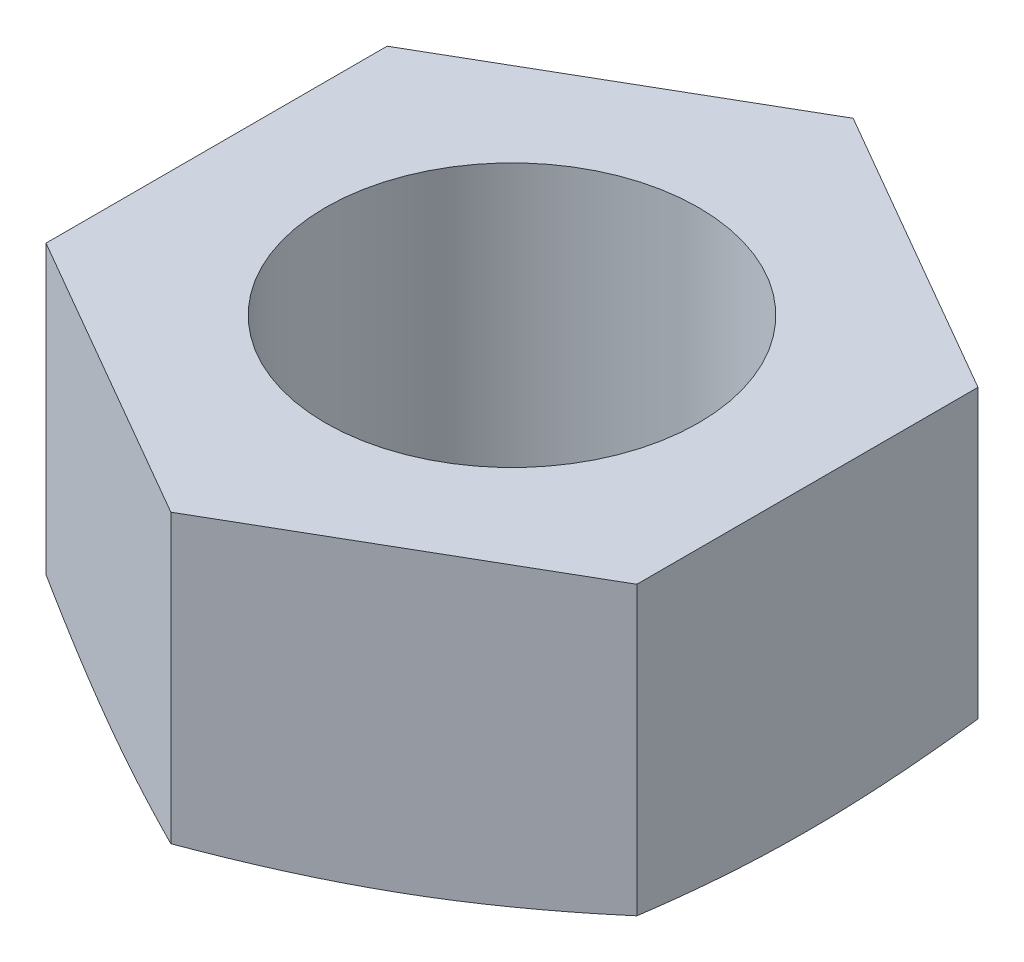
ISO-10303-21;
HEADER;
FILE_DESCRIPTION(('STEP AP214'),'2;1');
FILE_NAME('part.step','',(''),(''),'','','');
FILE_SCHEMA(('AUTOMOTIVE_DESIGN { 1 0 10303 214 1 1 1 1 }'));
ENDSEC;
DATA;
#1=APPLICATION_CONTEXT('core data for automotive mechanical design processes');
#2=APPLICATION_PROTOCOL_DEFINITION('international standard','automotive_design',2000,#1);
#3=PRODUCT_CONTEXT('',#1,'mechanical');
#4=PRODUCT('Part','Part','',(#3));
#5=PRODUCT_RELATED_PRODUCT_CATEGORY('part','',(#4));
#6=PRODUCT_DEFINITION_FORMATION('','',#4);
#7=PRODUCT_DEFINITION_CONTEXT('part definition',#1,'design');
#8=PRODUCT_DEFINITION('design','',#6,#7);
#9=PRODUCT_DEFINITION_SHAPE('','',#8);
#10=(LENGTH_UNIT() NAMED_UNIT(*) SI_UNIT(.MILLI.,.METRE.));
#11=(NAMED_UNIT(*) PLANE_ANGLE_UNIT() SI_UNIT($,.RADIAN.));
#12=(NAMED_UNIT(*) SI_UNIT($,.STERADIAN.) SOLID_ANGLE_UNIT());
#13=UNCERTAINTY_MEASURE_WITH_UNIT(LENGTH_MEASURE(1.E-05),#10,'distance_accuracy_value','');
#14=(GEOMETRIC_REPRESENTATION_CONTEXT(3) GLOBAL_UNCERTAINTY_ASSIGNED_CONTEXT((#13)) GLOBAL_UNIT_ASSIGNED_CONTEXT((#10,
#11,#12)) REPRESENTATION_CONTEXT('',''));
#15=CARTESIAN_POINT('',(0.,0.,0.));
#16=DIRECTION('',(0.,0.,1.));
#17=DIRECTION('',(1.,0.,0.));
#18=AXIS2_PLACEMENT_3D('',#15,#16,#17);
#19=CARTESIAN_POINT('',(0.,0.,0.));
#20=DIRECTION('',(0.,1.,0.));
#21=DIRECTION('',(0.,0.,1.));
#22=AXIS2_PLACEMENT_3D('',#19,#20,#21);
#23=CYLINDRICAL_SURFACE('',#22,6.);
#24=CARTESIAN_POINT('',(0.,0.,0.));
#25=DIRECTION('',(0.,1.,0.));
#26=DIRECTION('',(0.,0.,1.));
#27=AXIS2_PLACEMENT_3D('',#24,#25,#26);
#28=CIRCLE('',#27,6.);
#29=CARTESIAN_POINT('',(0.,0.,6.));
#30=VERTEX_POINT('',#29);
#31=EDGE_CURVE('E88',#30,#30,#28,.T.);
#32=ORIENTED_EDGE('',*,*,#31,.F.);
#33=EDGE_LOOP('',(#32));
#34=FACE_BOUND('',#33,.T.);
#35=CARTESIAN_POINT('',(0.,10.,0.));
#36=DIRECTION('',(0.,1.,0.));
#37=DIRECTION('',(0.,0.,1.));
#38=AXIS2_PLACEMENT_3D('',#35,#36,#37);
#39=CIRCLE('',#38,6.);
#40=CARTESIAN_POINT('',(0.,10.,6.));
#41=VERTEX_POINT('',#40);
#42=EDGE_CURVE('E199',#41,#41,#39,.T.);
#43=ORIENTED_EDGE('',*,*,#42,.T.);
#44=EDGE_LOOP('',(#43));
#45=FACE_BOUND('',#44,.T.);
#46=ADVANCED_FACE('F34',(#34,#45),#23,.F.);
#47=CARTESIAN_POINT('',(6.,0.,0.));
#48=DIRECTION('',(0.,1.,0.));
#49=DIRECTION('',(0.,0.,1.));
#50=AXIS2_PLACEMENT_3D('',#47,#48,#49);
#51=PLANE('',#50);
#52=CARTESIAN_POINT('',(0.,0.,0.));
#53=DIRECTION('',(0.,1.,0.));
#54=DIRECTION('',(0.,0.,1.));
#55=AXIS2_PLACEMENT_3D('',#52,#53,#54);
#56=CIRCLE('',#55,8.);
#57=CARTESIAN_POINT('',(0.,0.,8.));
#58=VERTEX_POINT('',#57);
#59=EDGE_CURVE('E200',#58,#58,#56,.T.);
#60=ORIENTED_EDGE('',*,*,#59,.F.);
#61=EDGE_LOOP('',(#60));
#62=FACE_BOUND('',#61,.T.);
#63=ORIENTED_EDGE('',*,*,#31,.T.);
#64=EDGE_LOOP('',(#63));
#65=FACE_BOUND('',#64,.T.);
#66=ADVANCED_FACE('F186',(#62,#65),#51,.F.);
#67=CARTESIAN_POINT('',(0.,0.,0.));
#68=DIRECTION('',(0.,1.,0.));
#69=DIRECTION('',(0.,0.,1.));
#70=AXIS2_PLACEMENT_3D('',#67,#68,#69);
#71=CONICAL_SURFACE('',#70,8.,1.31824205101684);
#72=CARTESIAN_POINT('',(-9.5,2.40648585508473,-14.4882788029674));
#73=CARTESIAN_POINT('',(-9.5,2.31353632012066,-14.057459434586));
#74=CARTESIAN_POINT('',(-9.5,2.22173138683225,-13.626388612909));
#75=CARTESIAN_POINT('',(-9.5,2.04102702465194,-12.7636209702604));
#76=CARTESIAN_POINT('',(-9.5,1.95212771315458,-12.33192412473));
#77=CARTESIAN_POINT('',(-9.5,1.77777878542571,-11.467420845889));
#78=CARTESIAN_POINT('',(-9.5,1.69233239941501,-11.0346137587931));
#79=CARTESIAN_POINT('',(-9.5,1.52580796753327,-10.1681604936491));
#80=CARTESIAN_POINT('',(-9.5,1.44472988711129,-9.73451432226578));
#81=CARTESIAN_POINT('',(-9.5,1.28856082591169,-8.86946261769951));
#82=CARTESIAN_POINT('',(-9.5,1.21342988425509,-8.43806433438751));
#83=CARTESIAN_POINT('',(-9.5,1.06976211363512,-7.57417304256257));
#84=CARTESIAN_POINT('',(-9.5,1.00122514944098,-7.14168005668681));
#85=CARTESIAN_POINT('',(-9.5,0.872288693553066,-6.27552430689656));
#86=CARTESIAN_POINT('',(-9.5,0.811888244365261,-5.84186168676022));
#87=CARTESIAN_POINT('',(-9.5,0.701002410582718,-4.97325626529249));
#88=CARTESIAN_POINT('',(-9.5,0.650517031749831,-4.53831346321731));
#89=CARTESIAN_POINT('',(-9.5,0.56092382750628,-3.66262834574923));
#90=CARTESIAN_POINT('',(-9.5,0.521940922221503,-3.22187305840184));
#91=CARTESIAN_POINT('',(-9.5,0.457968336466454,-2.33933938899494));
#92=CARTESIAN_POINT('',(-9.5,0.432978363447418,-1.89756102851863));
#93=CARTESIAN_POINT('',(-9.5,0.398434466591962,-1.01357299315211));
#94=CARTESIAN_POINT('',(-9.5,0.388874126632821,-0.571363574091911));
#95=CARTESIAN_POINT('',(-9.5,0.385772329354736,0.313112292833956));
#96=CARTESIAN_POINT('',(-9.5,0.392230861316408,0.755378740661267));
#97=CARTESIAN_POINT('',(-9.5,0.42080494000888,1.64090570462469));
#98=CARTESIAN_POINT('',(-9.5,0.442973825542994,2.08416446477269));
#99=CARTESIAN_POINT('',(-9.5,0.501713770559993,2.9697178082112));
#100=CARTESIAN_POINT('',(-9.5,0.538285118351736,3.41201237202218));
#101=CARTESIAN_POINT('',(-9.5,0.623998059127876,4.29563026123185));
#102=CARTESIAN_POINT('',(-9.5,0.673147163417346,4.73695284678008));
#103=CARTESIAN_POINT('',(-9.5,0.781986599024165,5.61828182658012));
#104=CARTESIAN_POINT('',(-9.5,0.841676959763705,6.05828821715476));
#105=CARTESIAN_POINT('',(-9.5,0.966109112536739,6.91238282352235));
#106=CARTESIAN_POINT('',(-9.5,1.03037972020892,7.32654037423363));
#107=CARTESIAN_POINT('',(-9.5,1.1652324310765,8.15383175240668));
#108=CARTESIAN_POINT('',(-9.5,1.2358146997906,8.5669655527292));
#109=CARTESIAN_POINT('',(-9.5,1.38213244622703,9.39235635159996));
#110=CARTESIAN_POINT('',(-9.5,1.45786842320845,9.80461326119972));
#111=CARTESIAN_POINT('',(-9.5,1.61353887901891,10.6283269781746));
#112=CARTESIAN_POINT('',(-9.5,1.69347332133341,11.039783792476));
#113=CARTESIAN_POINT('',(-9.5,1.85679736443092,11.8621121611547));
#114=CARTESIAN_POINT('',(-9.5,1.9401877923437,12.2729835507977));
#115=CARTESIAN_POINT('',(-9.5,2.10980112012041,13.0941421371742));
#116=CARTESIAN_POINT('',(-9.5,2.19602403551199,13.5044293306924));
#117=CARTESIAN_POINT('',(-9.5,2.45817342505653,14.7344932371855));
#118=CARTESIAN_POINT('',(-9.5,2.63759126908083,15.5535255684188));
#119=CARTESIAN_POINT('',(-9.5,3.00120652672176,17.1825154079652));
#120=CARTESIAN_POINT('',(-9.5,3.18534388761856,17.9924864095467));
#121=CARTESIAN_POINT('',(-9.5,3.55823048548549,19.6113792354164));
#122=CARTESIAN_POINT('',(-9.5,3.74697980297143,20.4203010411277));
#123=CARTESIAN_POINT('',(-9.5,4.12765078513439,22.0363851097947));
#124=CARTESIAN_POINT('',(-9.5,4.31956842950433,22.8435483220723));
#125=CARTESIAN_POINT('',(-9.5,4.70601611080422,24.4572229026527));
#126=CARTESIAN_POINT('',(-9.5,4.90054606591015,25.2637342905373));
#127=CARTESIAN_POINT('',(-9.5,5.09599951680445,26.0700192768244));
#128=B_SPLINE_CURVE_WITH_KNOTS('',3,(#72,#73,#74,#75,#76,#77,#78,#79,#80,#81,#82,#83,#84,#85,
#86,#87,#88,#89,#90,#91,#92,#93,#94,#95,#96,#97,#98,#99,#100,#101,#102,#103,#104,#105,#106,#107,
#108,#109,#110,#111,#112,#113,#114,#115,#116,#117,#118,#119,#120,#121,#122,#123,#124,#125,#126,
#127),.UNSPECIFIED.,.F.,.F.,(4,2,2,2,2,2,2,2,2,2,2,2,2,2,2,2,2,2,2,2,2,2,2,2,2,2,2,4),(0.,
1.32220188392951,2.64445712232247,3.96792197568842,5.29137635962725,6.60501058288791,
7.91861786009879,9.23207041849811,10.5455237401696,11.8727566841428,13.1999618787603,
14.5266150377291,15.8532673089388,17.1844454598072,18.5156502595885,19.8476519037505,
21.1796572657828,22.4369438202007,23.6942633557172,24.9517048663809,26.2091354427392,
27.466868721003,28.7246088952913,31.2399261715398,33.7318247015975,36.2237667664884,
38.7127586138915,41.201672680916),.UNSPECIFIED.);
#129=CARTESIAN_POINT('',(-9.5,0.7663626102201,5.48482755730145));
#130=VERTEX_POINT('',#129);
#131=CARTESIAN_POINT('',(-9.5,0.7663626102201,-5.48482755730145));
#132=VERTEX_POINT('',#131);
#133=EDGE_CURVE('E168',#130,#132,#128,.F.);
#134=ORIENTED_EDGE('',*,*,#133,.T.);
#135=CARTESIAN_POINT('',(-9.5002,0.766392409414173,-5.48471208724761));
#136=CARTESIAN_POINT('',(-9.10557748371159,0.70757184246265,-5.71254750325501));
#137=CARTESIAN_POINT('',(-8.71029047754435,0.654181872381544,-5.94076656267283));
#138=CARTESIAN_POINT('',(-7.91842136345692,0.56039192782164,-6.39795240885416));
#139=CARTESIAN_POINT('',(-7.52183882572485,0.519996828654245,-6.62691944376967));
#140=CARTESIAN_POINT('',(-6.72961048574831,0.454529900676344,-7.08431268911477));
#141=CARTESIAN_POINT('',(-6.33396929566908,0.429385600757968,-7.31273623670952));
#142=CARTESIAN_POINT('',(-5.54221867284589,0.395670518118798,-7.76985367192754));
#143=CARTESIAN_POINT('',(-5.14610933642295,0.387096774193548,-7.99854750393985));
#144=CARTESIAN_POINT('',(-4.35389066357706,0.387096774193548,-8.45593516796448));
#145=CARTESIAN_POINT('',(-3.95778132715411,0.395670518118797,-8.68462899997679));
#146=CARTESIAN_POINT('',(-3.16603070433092,0.429385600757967,-9.14174643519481));
#147=CARTESIAN_POINT('',(-2.77038951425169,0.454529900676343,-9.37016998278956));
#148=CARTESIAN_POINT('',(-1.97816117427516,0.519996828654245,-9.82756322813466));
#149=CARTESIAN_POINT('',(-1.58157863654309,0.560391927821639,-10.0565302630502));
#150=CARTESIAN_POINT('',(-0.789709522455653,0.654181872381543,-10.5137161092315));
#151=CARTESIAN_POINT('',(-0.394422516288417,0.707571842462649,-10.7419351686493));
#152=CARTESIAN_POINT('',(0.000199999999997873,0.766392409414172,-10.9697705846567));
#153=B_SPLINE_CURVE_WITH_KNOTS('',3,(#135,#136,#137,#138,#139,#140,#141,#142,#143,#144,#145,
#146,#147,#148,#149,#150,#151,#152),.UNSPECIFIED.,.F.,.F.,(4,2,2,2,2,2,2,2,4),(0.,
1.37842136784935,2.75735927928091,4.12969212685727,5.50177971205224,6.8738672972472,
8.24620014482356,9.62513805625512,11.0035594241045),.UNSPECIFIED.);
#154=CARTESIAN_POINT('',(0.,0.7663626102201,-10.9696551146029));
#155=VERTEX_POINT('',#154);
#156=EDGE_CURVE('E122',#132,#155,#153,.T.);
#157=ORIENTED_EDGE('',*,*,#156,.T.);
#158=CARTESIAN_POINT('',(-0.000200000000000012,0.766392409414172,-10.9697705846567));
#159=CARTESIAN_POINT('',(0.394422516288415,0.70757184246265,-10.7419351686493));
#160=CARTESIAN_POINT('',(0.789709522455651,0.654181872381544,-10.5137161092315));
#161=CARTESIAN_POINT('',(1.58157863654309,0.56039192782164,-10.0565302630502));
#162=CARTESIAN_POINT('',(1.97816117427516,0.519996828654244,-9.82756322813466));
#163=CARTESIAN_POINT('',(2.77038951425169,0.454529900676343,-9.37016998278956));
#164=CARTESIAN_POINT('',(3.16603070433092,0.429385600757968,-9.14174643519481));
#165=CARTESIAN_POINT('',(3.95778132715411,0.395670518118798,-8.68462899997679));
#166=CARTESIAN_POINT('',(4.35389066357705,0.387096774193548,-8.45593516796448));
#167=CARTESIAN_POINT('',(5.14610933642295,0.387096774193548,-7.99854750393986));
#168=CARTESIAN_POINT('',(5.54221867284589,0.395670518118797,-7.76985367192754));
#169=CARTESIAN_POINT('',(6.33396929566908,0.429385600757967,-7.31273623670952));
#170=CARTESIAN_POINT('',(6.72961048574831,0.454529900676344,-7.08431268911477));
#171=CARTESIAN_POINT('',(7.52183882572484,0.519996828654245,-6.62691944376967));
#172=CARTESIAN_POINT('',(7.91842136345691,0.56039192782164,-6.39795240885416));
#173=CARTESIAN_POINT('',(8.71029047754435,0.654181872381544,-5.94076656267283));
#174=CARTESIAN_POINT('',(9.10557748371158,0.70757184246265,-5.71254750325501));
#175=CARTESIAN_POINT('',(9.5002,0.766392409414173,-5.48471208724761));
#176=B_SPLINE_CURVE_WITH_KNOTS('',3,(#158,#159,#160,#161,#162,#163,#164,#165,#166,#167,#168,
#169,#170,#171,#172,#173,#174,#175),.UNSPECIFIED.,.F.,.F.,(4,2,2,2,2,2,2,2,4),(0.,
1.37842136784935,2.75735927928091,4.12969212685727,5.50177971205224,6.8738672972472,
8.24620014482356,9.62513805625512,11.0035594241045),.UNSPECIFIED.);
#177=CARTESIAN_POINT('',(9.5,0.7663626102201,-5.48482755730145));
#178=VERTEX_POINT('',#177);
#179=EDGE_CURVE('E123',#155,#178,#176,.T.);
#180=ORIENTED_EDGE('',*,*,#179,.T.);
#181=CARTESIAN_POINT('',(9.5,2.40648585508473,-14.4882788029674));
#182=CARTESIAN_POINT('',(9.5,2.31353632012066,-14.057459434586));
#183=CARTESIAN_POINT('',(9.5,2.22173138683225,-13.626388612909));
#184=CARTESIAN_POINT('',(9.5,2.04102702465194,-12.7636209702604));
#185=CARTESIAN_POINT('',(9.5,1.95212771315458,-12.33192412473));
#186=CARTESIAN_POINT('',(9.5,1.77777878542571,-11.467420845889));
#187=CARTESIAN_POINT('',(9.5,1.69233239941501,-11.0346137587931));
#188=CARTESIAN_POINT('',(9.5,1.52580796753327,-10.1681604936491));
#189=CARTESIAN_POINT('',(9.5,1.44472988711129,-9.73451432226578));
#190=CARTESIAN_POINT('',(9.5,1.28856082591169,-8.86946261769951));
#191=CARTESIAN_POINT('',(9.5,1.21342988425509,-8.43806433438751));
#192=CARTESIAN_POINT('',(9.5,1.06976211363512,-7.57417304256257));
#193=CARTESIAN_POINT('',(9.5,1.00122514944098,-7.14168005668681));
#194=CARTESIAN_POINT('',(9.5,0.872288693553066,-6.27552430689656));
#195=CARTESIAN_POINT('',(9.5,0.811888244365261,-5.84186168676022));
#196=CARTESIAN_POINT('',(9.5,0.701002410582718,-4.97325626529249));
#197=CARTESIAN_POINT('',(9.5,0.650517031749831,-4.53831346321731));
#198=CARTESIAN_POINT('',(9.5,0.56092382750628,-3.66262834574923));
#199=CARTESIAN_POINT('',(9.5,0.521940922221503,-3.22187305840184));
#200=CARTESIAN_POINT('',(9.5,0.457968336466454,-2.33933938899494));
#201=CARTESIAN_POINT('',(9.5,0.432978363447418,-1.89756102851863));
#202=CARTESIAN_POINT('',(9.5,0.398434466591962,-1.01357299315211));
#203=CARTESIAN_POINT('',(9.5,0.388874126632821,-0.571363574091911));
#204=CARTESIAN_POINT('',(9.5,0.385772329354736,0.313112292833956));
#205=CARTESIAN_POINT('',(9.5,0.392230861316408,0.755378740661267));
#206=CARTESIAN_POINT('',(9.5,0.42080494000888,1.64090570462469));
#207=CARTESIAN_POINT('',(9.5,0.442973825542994,2.08416446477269));
#208=CARTESIAN_POINT('',(9.5,0.501713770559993,2.9697178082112));
#209=CARTESIAN_POINT('',(9.5,0.538285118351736,3.41201237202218));
#210=CARTESIAN_POINT('',(9.5,0.623998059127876,4.29563026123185));
#211=CARTESIAN_POINT('',(9.5,0.673147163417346,4.73695284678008));
#212=CARTESIAN_POINT('',(9.5,0.781986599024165,5.61828182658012));
#213=CARTESIAN_POINT('',(9.5,0.841676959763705,6.05828821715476));
#214=CARTESIAN_POINT('',(9.5,0.966109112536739,6.91238282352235));
#215=CARTESIAN_POINT('',(9.5,1.03037972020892,7.32654037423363));
#216=CARTESIAN_POINT('',(9.5,1.1652324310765,8.15383175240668));
#217=CARTESIAN_POINT('',(9.5,1.2358146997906,8.5669655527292));
#218=CARTESIAN_POINT('',(9.5,1.38213244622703,9.39235635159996));
#219=CARTESIAN_POINT('',(9.5,1.45786842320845,9.80461326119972));
#220=CARTESIAN_POINT('',(9.5,1.61353887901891,10.6283269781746));
#221=CARTESIAN_POINT('',(9.5,1.69347332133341,11.039783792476));
#222=CARTESIAN_POINT('',(9.5,1.85679736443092,11.8621121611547));
#223=CARTESIAN_POINT('',(9.5,1.9401877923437,12.2729835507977));
#224=CARTESIAN_POINT('',(9.5,2.10980112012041,13.0941421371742));
#225=CARTESIAN_POINT('',(9.5,2.19602403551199,13.5044293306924));
#226=CARTESIAN_POINT('',(9.5,2.45817342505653,14.7344932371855));
#227=CARTESIAN_POINT('',(9.5,2.63759126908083,15.5535255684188));
#228=CARTESIAN_POINT('',(9.5,3.00120652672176,17.1825154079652));
#229=CARTESIAN_POINT('',(9.5,3.18534388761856,17.9924864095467));
#230=CARTESIAN_POINT('',(9.5,3.55823048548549,19.6113792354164));
#231=CARTESIAN_POINT('',(9.5,3.74697980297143,20.4203010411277));
#232=CARTESIAN_POINT('',(9.5,4.12765078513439,22.0363851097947));
#233=CARTESIAN_POINT('',(9.5,4.31956842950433,22.8435483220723));
#234=CARTESIAN_POINT('',(9.5,4.70601611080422,24.4572229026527));
#235=CARTESIAN_POINT('',(9.5,4.90054606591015,25.2637342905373));
#236=CARTESIAN_POINT('',(9.5,5.09599951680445,26.0700192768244));
#237=B_SPLINE_CURVE_WITH_KNOTS('',3,(#181,#182,#183,#184,#185,#186,#187,#188,#189,#190,#191,
#192,#193,#194,#195,#196,#197,#198,#199,#200,#201,#202,#203,#204,#205,#206,#207,#208,#209,#210,
#211,#212,#213,#214,#215,#216,#217,#218,#219,#220,#221,#222,#223,#224,#225,#226,#227,#228,#229,
#230,#231,#232,#233,#234,#235,#236),.UNSPECIFIED.,.F.,.F.,(4,2,2,2,2,2,2,2,2,2,2,2,2,2,2,2,2,2,
2,2,2,2,2,2,2,2,2,4),(0.,1.32220188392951,2.64445712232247,3.96792197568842,5.29137635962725,
6.60501058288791,7.91861786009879,9.23207041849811,10.5455237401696,11.8727566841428,
13.1999618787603,14.5266150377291,15.8532673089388,17.1844454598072,18.5156502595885,
19.8476519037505,21.1796572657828,22.4369438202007,23.6942633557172,24.9517048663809,
26.2091354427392,27.466868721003,28.7246088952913,31.2399261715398,33.7318247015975,
36.2237667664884,38.7127586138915,41.201672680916),.UNSPECIFIED.);
#238=CARTESIAN_POINT('',(9.5,0.7663626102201,5.48482755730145));
#239=VERTEX_POINT('',#238);
#240=EDGE_CURVE('E95',#178,#239,#237,.T.);
#241=ORIENTED_EDGE('',*,*,#240,.T.);
#242=CARTESIAN_POINT('',(9.5002,0.766392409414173,5.48471208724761));
#243=CARTESIAN_POINT('',(9.10557748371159,0.70757184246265,5.71254750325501));
#244=CARTESIAN_POINT('',(8.71029047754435,0.654181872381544,5.94076656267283));
#245=CARTESIAN_POINT('',(7.91842136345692,0.56039192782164,6.39795240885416));
#246=CARTESIAN_POINT('',(7.52183882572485,0.519996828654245,6.62691944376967));
#247=CARTESIAN_POINT('',(6.72961048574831,0.454529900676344,7.08431268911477));
#248=CARTESIAN_POINT('',(6.33396929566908,0.429385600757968,7.31273623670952));
#249=CARTESIAN_POINT('',(5.54221867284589,0.395670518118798,7.76985367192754));
#250=CARTESIAN_POINT('',(5.14610933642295,0.387096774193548,7.99854750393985));
#251=CARTESIAN_POINT('',(4.35389066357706,0.387096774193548,8.45593516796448));
#252=CARTESIAN_POINT('',(3.95778132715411,0.395670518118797,8.68462899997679));
#253=CARTESIAN_POINT('',(3.16603070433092,0.429385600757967,9.14174643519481));
#254=CARTESIAN_POINT('',(2.77038951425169,0.454529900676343,9.37016998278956));
#255=CARTESIAN_POINT('',(1.97816117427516,0.519996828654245,9.82756322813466));
#256=CARTESIAN_POINT('',(1.58157863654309,0.560391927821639,10.0565302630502));
#257=CARTESIAN_POINT('',(0.789709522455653,0.654181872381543,10.5137161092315));
#258=CARTESIAN_POINT('',(0.394422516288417,0.707571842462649,10.7419351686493));
#259=CARTESIAN_POINT('',(-0.000199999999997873,0.766392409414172,10.9697705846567));
#260=B_SPLINE_CURVE_WITH_KNOTS('',3,(#242,#243,#244,#245,#246,#247,#248,#249,#250,#251,#252,
#253,#254,#255,#256,#257,#258,#259),.UNSPECIFIED.,.F.,.F.,(4,2,2,2,2,2,2,2,4),(0.,
1.37842136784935,2.75735927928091,4.12969212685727,5.50177971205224,6.8738672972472,
8.24620014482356,9.62513805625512,11.0035594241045),.UNSPECIFIED.);
#261=CARTESIAN_POINT('',(0.,0.7663626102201,10.9696551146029));
#262=VERTEX_POINT('',#261);
#263=EDGE_CURVE('E156',#239,#262,#260,.T.);
#264=ORIENTED_EDGE('',*,*,#263,.T.);
#265=CARTESIAN_POINT('',(0.000200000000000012,0.766392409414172,10.9697705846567));
#266=CARTESIAN_POINT('',(-0.394422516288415,0.70757184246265,10.7419351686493));
#267=CARTESIAN_POINT('',(-0.789709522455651,0.654181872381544,10.5137161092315));
#268=CARTESIAN_POINT('',(-1.58157863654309,0.56039192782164,10.0565302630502));
#269=CARTESIAN_POINT('',(-1.97816117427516,0.519996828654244,9.82756322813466));
#270=CARTESIAN_POINT('',(-2.77038951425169,0.454529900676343,9.37016998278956));
#271=CARTESIAN_POINT('',(-3.16603070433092,0.429385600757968,9.14174643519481));
#272=CARTESIAN_POINT('',(-3.95778132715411,0.395670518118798,8.68462899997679));
#273=CARTESIAN_POINT('',(-4.35389066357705,0.387096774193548,8.45593516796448));
#274=CARTESIAN_POINT('',(-5.14610933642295,0.387096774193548,7.99854750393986));
#275=CARTESIAN_POINT('',(-5.54221867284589,0.395670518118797,7.76985367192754));
#276=CARTESIAN_POINT('',(-6.33396929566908,0.429385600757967,7.31273623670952));
#277=CARTESIAN_POINT('',(-6.72961048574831,0.454529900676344,7.08431268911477));
#278=CARTESIAN_POINT('',(-7.52183882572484,0.519996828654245,6.62691944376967));
#279=CARTESIAN_POINT('',(-7.91842136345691,0.56039192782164,6.39795240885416));
#280=CARTESIAN_POINT('',(-8.71029047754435,0.654181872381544,5.94076656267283));
#281=CARTESIAN_POINT('',(-9.10557748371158,0.70757184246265,5.71254750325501));
#282=CARTESIAN_POINT('',(-9.5002,0.766392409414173,5.48471208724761));
#283=B_SPLINE_CURVE_WITH_KNOTS('',3,(#265,#266,#267,#268,#269,#270,#271,#272,#273,#274,#275,
#276,#277,#278,#279,#280,#281,#282),.UNSPECIFIED.,.F.,.F.,(4,2,2,2,2,2,2,2,4),(0.,
1.37842136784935,2.75735927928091,4.12969212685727,5.50177971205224,6.8738672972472,
8.24620014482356,9.62513805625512,11.0035594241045),.UNSPECIFIED.);
#284=EDGE_CURVE('E162',#262,#130,#283,.T.);
#285=ORIENTED_EDGE('',*,*,#284,.T.);
#286=EDGE_LOOP('',(#134,#157,#180,#241,#264,#285));
#287=FACE_BOUND('',#286,.T.);
#288=ORIENTED_EDGE('',*,*,#59,.T.);
#289=EDGE_LOOP('',(#288));
#290=FACE_BOUND('',#289,.T.);
#291=ADVANCED_FACE('F140',(#287,#290),#71,.T.);
#292=CARTESIAN_POINT('',(11.875,10.,0.));
#293=DIRECTION('',(0.,-1.,0.));
#294=DIRECTION('',(0.,0.,-1.));
#295=AXIS2_PLACEMENT_3D('',#292,#293,#294);
#296=PLANE('',#295);
#297=DIRECTION('',(-0.866025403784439,0.,-0.5));
#298=VECTOR('',#297,1.);
#299=CARTESIAN_POINT('',(13.65625,10.,-3.08521550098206));
#300=LINE('',#299,#298);
#301=CARTESIAN_POINT('',(9.5,10.,-5.48482755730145));
#302=VERTEX_POINT('',#301);
#303=CARTESIAN_POINT('',(0.,10.,-10.9696551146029));
#304=VERTEX_POINT('',#303);
#305=EDGE_CURVE('E83',#302,#304,#300,.T.);
#306=ORIENTED_EDGE('',*,*,#305,.T.);
#307=DIRECTION('',(-0.866025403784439,0.,0.5));
#308=VECTOR('',#307,1.);
#309=CARTESIAN_POINT('',(4.15625,10.,-13.3692671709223));
#310=LINE('',#309,#308);
#311=CARTESIAN_POINT('',(-9.5,10.,-5.48482755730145));
#312=VERTEX_POINT('',#311);
#313=EDGE_CURVE('E11',#304,#312,#310,.T.);
#314=ORIENTED_EDGE('',*,*,#313,.T.);
#315=DIRECTION('',(0.,0.,1.));
#316=VECTOR('',#315,1.);
#317=CARTESIAN_POINT('',(-9.5,10.,0.));
#318=LINE('',#317,#316);
#319=CARTESIAN_POINT('',(-9.5,10.,5.48482755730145));
#320=VERTEX_POINT('',#319);
#321=EDGE_CURVE('E41',#312,#320,#318,.T.);
#322=ORIENTED_EDGE('',*,*,#321,.T.);
#323=DIRECTION('',(0.866025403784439,0.,0.5));
#324=VECTOR('',#323,1.);
#325=CARTESIAN_POINT('',(4.15625,10.,13.3692671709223));
#326=LINE('',#325,#324);
#327=CARTESIAN_POINT('',(0.,10.,10.9696551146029));
#328=VERTEX_POINT('',#327);
#329=EDGE_CURVE('E105',#320,#328,#326,.T.);
#330=ORIENTED_EDGE('',*,*,#329,.T.);
#331=DIRECTION('',(0.866025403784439,0.,-0.5));
#332=VECTOR('',#331,1.);
#333=CARTESIAN_POINT('',(13.65625,10.,3.08521550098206));
#334=LINE('',#333,#332);
#335=CARTESIAN_POINT('',(9.5,10.,5.48482755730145));
#336=VERTEX_POINT('',#335);
#337=EDGE_CURVE('E103',#328,#336,#334,.T.);
#338=ORIENTED_EDGE('',*,*,#337,.T.);
#339=DIRECTION('',(0.,0.,-1.));
#340=VECTOR('',#339,1.);
#341=CARTESIAN_POINT('',(9.5,10.,0.));
#342=LINE('',#341,#340);
#343=EDGE_CURVE('E87',#336,#302,#342,.T.);
#344=ORIENTED_EDGE('',*,*,#343,.T.);
#345=EDGE_LOOP('',(#306,#314,#322,#330,#338,#344));
#346=FACE_BOUND('',#345,.T.);
#347=ORIENTED_EDGE('',*,*,#42,.F.);
#348=EDGE_LOOP('',(#347));
#349=FACE_BOUND('',#348,.T.);
#350=ADVANCED_FACE('F100',(#346,#349),#296,.F.);
#351=CARTESIAN_POINT('',(0.,11.,-10.9696551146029));
#352=DIRECTION('',(0.5,0.,0.866025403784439));
#353=DIRECTION('',(0.866025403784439,0.,-0.5));
#354=AXIS2_PLACEMENT_3D('',#351,#352,#353);
#355=PLANE('',#354);
#356=DIRECTION('',(0.,-1.,0.));
#357=VECTOR('',#356,1.);
#358=CARTESIAN_POINT('',(-9.5,11.,-5.48482755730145));
#359=LINE('',#358,#357);
#360=EDGE_CURVE('E115',#312,#132,#359,.T.);
#361=ORIENTED_EDGE('',*,*,#360,.F.);
#362=ORIENTED_EDGE('',*,*,#313,.F.);
#363=DIRECTION('',(0.,-1.,0.));
#364=VECTOR('',#363,1.);
#365=CARTESIAN_POINT('',(0.,11.,-10.9696551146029));
#366=LINE('',#365,#364);
#367=EDGE_CURVE('E53',#304,#155,#366,.T.);
#368=ORIENTED_EDGE('',*,*,#367,.T.);
#369=ORIENTED_EDGE('',*,*,#156,.F.);
#370=EDGE_LOOP('',(#361,#362,#368,#369));
#371=FACE_BOUND('',#370,.T.);
#372=ADVANCED_FACE('F120',(#371),#355,.F.);
#373=CARTESIAN_POINT('',(-9.5,11.,-5.48482755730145));
#374=DIRECTION('',(1.,0.,0.));
#375=DIRECTION('',(0.,0.,-1.));
#376=AXIS2_PLACEMENT_3D('',#373,#374,#375);
#377=PLANE('',#376);
#378=DIRECTION('',(0.,-1.,0.));
#379=VECTOR('',#378,1.);
#380=CARTESIAN_POINT('',(-9.5,11.,5.48482755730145));
#381=LINE('',#380,#379);
#382=EDGE_CURVE('E118',#320,#130,#381,.T.);
#383=ORIENTED_EDGE('',*,*,#382,.F.);
#384=ORIENTED_EDGE('',*,*,#321,.F.);
#385=ORIENTED_EDGE('',*,*,#360,.T.);
#386=ORIENTED_EDGE('',*,*,#133,.F.);
#387=EDGE_LOOP('',(#383,#384,#385,#386));
#388=FACE_BOUND('',#387,.T.);
#389=ADVANCED_FACE('F114',(#388),#377,.F.);
#390=CARTESIAN_POINT('',(-9.5,11.,5.48482755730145));
#391=DIRECTION('',(0.5,0.,-0.866025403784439));
#392=DIRECTION('',(-0.866025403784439,0.,-0.5));
#393=AXIS2_PLACEMENT_3D('',#390,#391,#392);
#394=PLANE('',#393);
#395=DIRECTION('',(0.,-1.,0.));
#396=VECTOR('',#395,1.);
#397=CARTESIAN_POINT('',(0.,11.,10.9696551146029));
#398=LINE('',#397,#396);
#399=EDGE_CURVE('E126',#328,#262,#398,.T.);
#400=ORIENTED_EDGE('',*,*,#399,.F.);
#401=ORIENTED_EDGE('',*,*,#329,.F.);
#402=ORIENTED_EDGE('',*,*,#382,.T.);
#403=ORIENTED_EDGE('',*,*,#284,.F.);
#404=EDGE_LOOP('',(#400,#401,#402,#403));
#405=FACE_BOUND('',#404,.T.);
#406=ADVANCED_FACE('F152',(#405),#394,.F.);
#407=CARTESIAN_POINT('',(0.,11.,10.9696551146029));
#408=DIRECTION('',(-0.5,0.,-0.866025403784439));
#409=DIRECTION('',(-0.866025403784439,0.,0.5));
#410=AXIS2_PLACEMENT_3D('',#407,#408,#409);
#411=PLANE('',#410);
#412=DIRECTION('',(0.,-1.,0.));
#413=VECTOR('',#412,1.);
#414=CARTESIAN_POINT('',(9.5,11.,5.48482755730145));
#415=LINE('',#414,#413);
#416=EDGE_CURVE('E97',#336,#239,#415,.T.);
#417=ORIENTED_EDGE('',*,*,#416,.F.);
#418=ORIENTED_EDGE('',*,*,#337,.F.);
#419=ORIENTED_EDGE('',*,*,#399,.T.);
#420=ORIENTED_EDGE('',*,*,#263,.F.);
#421=EDGE_LOOP('',(#417,#418,#419,#420));
#422=FACE_BOUND('',#421,.T.);
#423=ADVANCED_FACE('F148',(#422),#411,.F.);
#424=CARTESIAN_POINT('',(9.5,11.,5.48482755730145));
#425=DIRECTION('',(-1.,0.,0.));
#426=DIRECTION('',(0.,0.,1.));
#427=AXIS2_PLACEMENT_3D('',#424,#425,#426);
#428=PLANE('',#427);
#429=DIRECTION('',(0.,-1.,0.));
#430=VECTOR('',#429,1.);
#431=CARTESIAN_POINT('',(9.5,11.,-5.48482755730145));
#432=LINE('',#431,#430);
#433=EDGE_CURVE('E48',#302,#178,#432,.T.);
#434=ORIENTED_EDGE('',*,*,#433,.F.);
#435=ORIENTED_EDGE('',*,*,#343,.F.);
#436=ORIENTED_EDGE('',*,*,#416,.T.);
#437=ORIENTED_EDGE('',*,*,#240,.F.);
#438=EDGE_LOOP('',(#434,#435,#436,#437));
#439=FACE_BOUND('',#438,.T.);
#440=ADVANCED_FACE('F91',(#439),#428,.F.);
#441=CARTESIAN_POINT('',(9.5,11.,-5.48482755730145));
#442=DIRECTION('',(-0.5,0.,0.866025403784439));
#443=DIRECTION('',(0.866025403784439,0.,0.5));
#444=AXIS2_PLACEMENT_3D('',#441,#442,#443);
#445=PLANE('',#444);
#446=ORIENTED_EDGE('',*,*,#367,.F.);
#447=ORIENTED_EDGE('',*,*,#305,.F.);
#448=ORIENTED_EDGE('',*,*,#433,.T.);
#449=ORIENTED_EDGE('',*,*,#179,.F.);
#450=EDGE_LOOP('',(#446,#447,#448,#449));
#451=FACE_BOUND('',#450,.T.);
#452=ADVANCED_FACE('F84',(#451),#445,.F.);
#453=CLOSED_SHELL('',(#46,#66,#291,#350,#372,#389,#406,#423,#440,#452));
#454=MANIFOLD_SOLID_BREP('B2',#453);
#455=ADVANCED_BREP_SHAPE_REPRESENTATION('',(#18,#454),#14);
#456=SHAPE_DEFINITION_REPRESENTATION(#9,#455);
ENDSEC;
END-ISO-10303-21;
